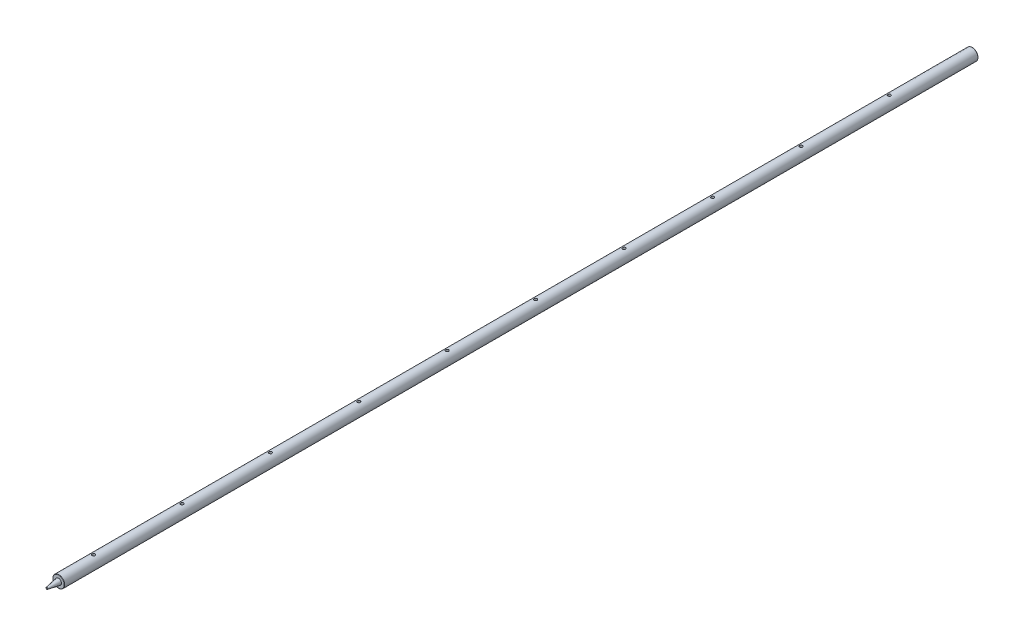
from build123d import *

# Parameters (mm, degrees)
FILLET1_R           = 0.508
LPATTERN1_COUNT     = 8
LPATTERN1_PITCH     = 150
LPATTERN1_COL_COUNT = 3
LPATTERN1_COL_PITCH = 150


with BuildPart() as part:
    # Sketch1 → Revolve1 (revolve)
    with BuildSketch(Plane(origin=(0, 0, 0), x_dir=(1, 0, 0), z_dir=(0, 1, 0)), mode=Mode.PRIVATE) as revolve1_sk:
        Polygon((0, 1550), (0, -20), (1.473460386, -20), (5, 0), (10, 0), (10, 1550), align=None)
    revolve(revolve1_sk.sketch.rotate(Axis((0, 0, -1550), (0, 0, 1)), 180), axis=Axis((0, 0, -1550), (0, 0, 1)))

    # Fillet1
    fillet1_edges = [part.edges().sort_by_distance(p)[0] for p in [
        (10, 0, -1550),
        (10, 0, 0),
        (1.473460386, 0, 20),
    ]]
    fillet(fillet1_edges, radius=FILLET1_R)

    # Sketch3 → M6x1.0 Tapped Hole1 (revolve, cut)
    with BuildSketch(Plane(origin=(0, 10, -1109.22499992), x_dir=(0, 0, 1), z_dir=(1, 0, 0))):
        Polygon((0, 0), (0, 16.502151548), (2.5, 15), (2.5, 0), align=None)
    m6x1_0_tapped_hole1 = revolve(axis=Axis((0, 16.35, -1109.22499992), (0, -1, 0)), mode=Mode.SUBTRACT)

    # LPattern1: M6x1.0 Tapped Hole1 ×8
    with Locations(*[(0, 0, i * LPATTERN1_PITCH) for i in range(1, LPATTERN1_COUNT)]):
        add(m6x1_0_tapped_hole1, mode=Mode.SUBTRACT)

    # LPattern1 col: M6x1.0 Tapped Hole1 ×3
    with Locations(*[(0, 0, -i * LPATTERN1_COL_PITCH) for i in range(1, LPATTERN1_COL_COUNT)]):
        add(m6x1_0_tapped_hole1, mode=Mode.SUBTRACT)


solid = part.part
